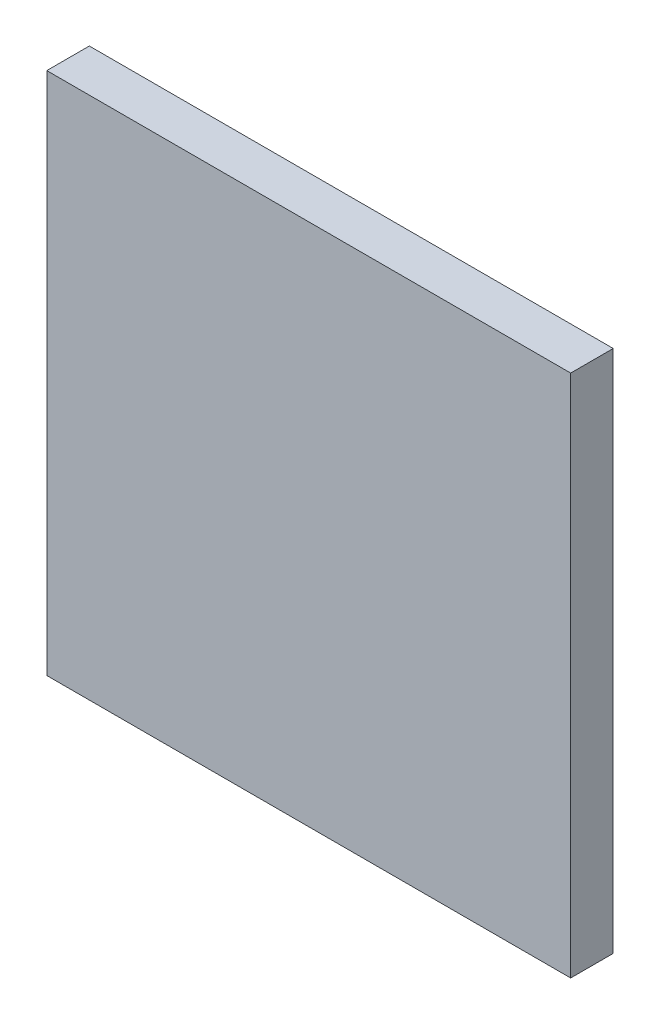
from build123d import *

# Parameters (mm, degrees)
ESQUISSE1_W        = 8
ESQUISSE1_H        = 8
BOSS_EXTRU_1_DEPTH = 0.65


with BuildPart() as part:
    # Esquisse1 → Boss.-Extru.1 (new body)
    with BuildSketch(Plane.XY):
        Rectangle(ESQUISSE1_W, ESQUISSE1_H)
    extrude(amount=BOSS_EXTRU_1_DEPTH)


solid = part.part
